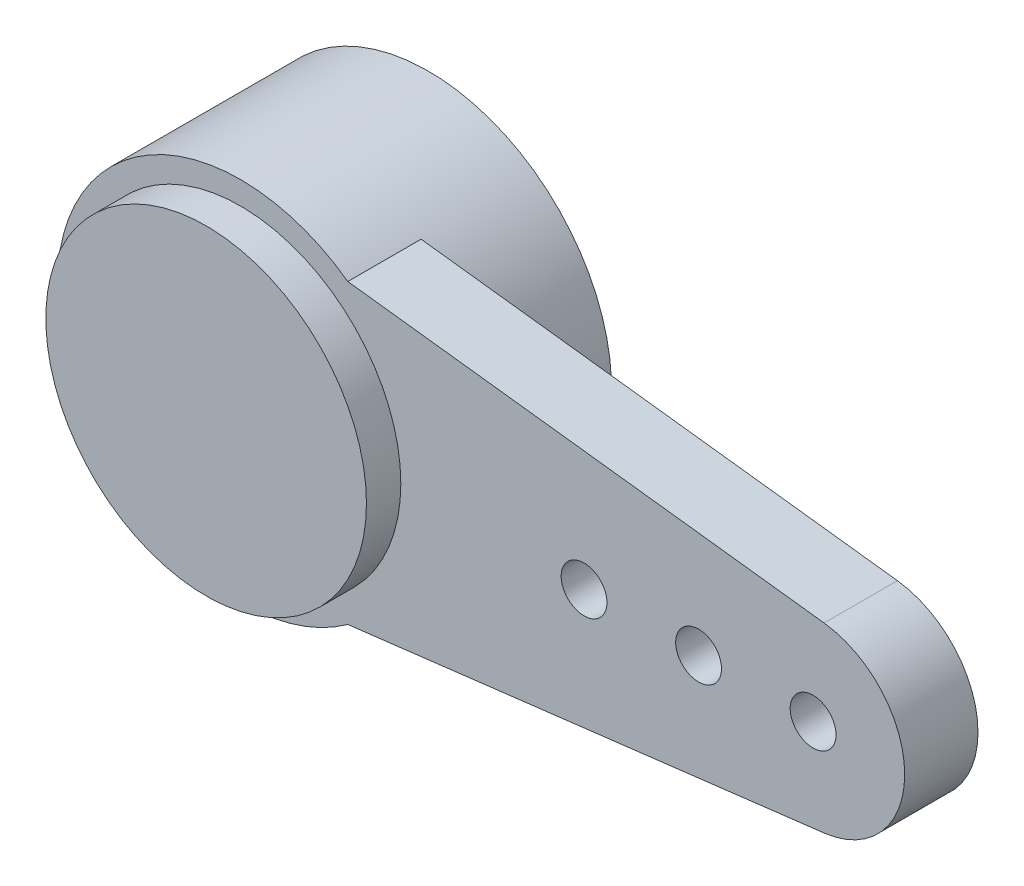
ISO-10303-21;
HEADER;
FILE_DESCRIPTION(('STEP AP214'),'2;1');
FILE_NAME('part.step','',(''),(''),'','','');
FILE_SCHEMA(('AUTOMOTIVE_DESIGN { 1 0 10303 214 1 1 1 1 }'));
ENDSEC;
DATA;
#1=APPLICATION_CONTEXT('core data for automotive mechanical design processes');
#2=APPLICATION_PROTOCOL_DEFINITION('international standard','automotive_design',2000,#1);
#3=PRODUCT_CONTEXT('',#1,'mechanical');
#4=PRODUCT('Part','Part','',(#3));
#5=PRODUCT_RELATED_PRODUCT_CATEGORY('part','',(#4));
#6=PRODUCT_DEFINITION_FORMATION('','',#4);
#7=PRODUCT_DEFINITION_CONTEXT('part definition',#1,'design');
#8=PRODUCT_DEFINITION('design','',#6,#7);
#9=PRODUCT_DEFINITION_SHAPE('','',#8);
#10=(LENGTH_UNIT() NAMED_UNIT(*) SI_UNIT(.MILLI.,.METRE.));
#11=(NAMED_UNIT(*) PLANE_ANGLE_UNIT() SI_UNIT($,.RADIAN.));
#12=(NAMED_UNIT(*) SI_UNIT($,.STERADIAN.) SOLID_ANGLE_UNIT());
#13=UNCERTAINTY_MEASURE_WITH_UNIT(LENGTH_MEASURE(1.E-05),#10,'distance_accuracy_value','');
#14=(GEOMETRIC_REPRESENTATION_CONTEXT(3) GLOBAL_UNCERTAINTY_ASSIGNED_CONTEXT((#13)) GLOBAL_UNIT_ASSIGNED_CONTEXT((#10,
#11,#12)) REPRESENTATION_CONTEXT('',''));
#15=CARTESIAN_POINT('',(0.,0.,0.));
#16=DIRECTION('',(0.,0.,1.));
#17=DIRECTION('',(1.,0.,0.));
#18=AXIS2_PLACEMENT_3D('',#15,#16,#17);
#19=CARTESIAN_POINT('',(0.,0.,1.6));
#20=DIRECTION('',(0.,0.,1.));
#21=DIRECTION('',(1.,0.,0.));
#22=AXIS2_PLACEMENT_3D('',#19,#20,#21);
#23=PLANE('',#22);
#24=DIRECTION('',(-0.992773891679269,0.12,0.));
#25=VECTOR('',#24,1.);
#26=CARTESIAN_POINT('',(0.42,3.47470862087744,1.6));
#27=LINE('',#26,#25);
#28=CARTESIAN_POINT('',(12.74,1.98554778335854,1.6));
#29=VERTEX_POINT('',#28);
#30=CARTESIAN_POINT('',(2.34249837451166,3.242329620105,1.6));
#31=VERTEX_POINT('',#30);
#32=EDGE_CURVE('E87',#29,#31,#27,.T.);
#33=ORIENTED_EDGE('',*,*,#32,.T.);
#34=CARTESIAN_POINT('',(0.,0.,1.6));
#35=DIRECTION('',(0.,0.,1.));
#36=DIRECTION('',(1.,0.,0.));
#37=AXIS2_PLACEMENT_3D('',#34,#35,#36);
#38=CIRCLE('',#37,4.);
#39=CARTESIAN_POINT('',(2.34249837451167,-3.242329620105,1.6));
#40=VERTEX_POINT('',#39);
#41=EDGE_CURVE('E49',#40,#31,#38,.F.);
#42=ORIENTED_EDGE('',*,*,#41,.F.);
#43=DIRECTION('',(0.992773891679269,0.12,0.));
#44=VECTOR('',#43,1.);
#45=CARTESIAN_POINT('',(12.74,-1.98554778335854,1.6));
#46=LINE('',#45,#44);
#47=CARTESIAN_POINT('',(12.74,-1.98554778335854,1.6));
#48=VERTEX_POINT('',#47);
#49=EDGE_CURVE('E36',#40,#48,#46,.T.);
#50=ORIENTED_EDGE('',*,*,#49,.T.);
#51=CARTESIAN_POINT('',(12.5,0.,1.6));
#52=DIRECTION('',(0.,0.,1.));
#53=DIRECTION('',(1.,0.,0.));
#54=AXIS2_PLACEMENT_3D('',#51,#52,#53);
#55=CIRCLE('',#54,2.);
#56=EDGE_CURVE('E57',#48,#29,#55,.T.);
#57=ORIENTED_EDGE('',*,*,#56,.T.);
#58=EDGE_LOOP('',(#33,#42,#50,#57));
#59=FACE_BOUND('',#58,.T.);
#60=CARTESIAN_POINT('',(10.,0.,1.6));
#61=DIRECTION('',(0.,0.,1.));
#62=DIRECTION('',(1.,0.,0.));
#63=AXIS2_PLACEMENT_3D('',#60,#61,#62);
#64=CIRCLE('',#63,0.500000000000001);
#65=CARTESIAN_POINT('',(10.5,0.,1.6));
#66=VERTEX_POINT('',#65);
#67=EDGE_CURVE('E114',#66,#66,#64,.T.);
#68=ORIENTED_EDGE('',*,*,#67,.F.);
#69=EDGE_LOOP('',(#68));
#70=FACE_BOUND('',#69,.T.);
#71=CARTESIAN_POINT('',(7.5,0.,1.6));
#72=DIRECTION('',(0.,0.,1.));
#73=DIRECTION('',(1.,0.,0.));
#74=AXIS2_PLACEMENT_3D('',#71,#72,#73);
#75=CIRCLE('',#74,0.500000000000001);
#76=CARTESIAN_POINT('',(8.,0.,1.6));
#77=VERTEX_POINT('',#76);
#78=EDGE_CURVE('E107',#77,#77,#75,.T.);
#79=ORIENTED_EDGE('',*,*,#78,.F.);
#80=EDGE_LOOP('',(#79));
#81=FACE_BOUND('',#80,.T.);
#82=CARTESIAN_POINT('',(12.5,0.,1.6));
#83=DIRECTION('',(0.,0.,1.));
#84=DIRECTION('',(1.,0.,0.));
#85=AXIS2_PLACEMENT_3D('',#82,#83,#84);
#86=CIRCLE('',#85,0.500000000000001);
#87=CARTESIAN_POINT('',(13.,0.,1.6));
#88=VERTEX_POINT('',#87);
#89=EDGE_CURVE('E119',#88,#88,#86,.T.);
#90=ORIENTED_EDGE('',*,*,#89,.F.);
#91=EDGE_LOOP('',(#90));
#92=FACE_BOUND('',#91,.T.);
#93=CARTESIAN_POINT('',(0.,0.,1.6));
#94=DIRECTION('',(0.,0.,1.));
#95=DIRECTION('',(1.,0.,0.));
#96=AXIS2_PLACEMENT_3D('',#93,#94,#95);
#97=CIRCLE('',#96,3.5);
#98=CARTESIAN_POINT('',(3.5,0.,1.6));
#99=VERTEX_POINT('',#98);
#100=EDGE_CURVE('E42',#99,#99,#97,.T.);
#101=ORIENTED_EDGE('',*,*,#100,.F.);
#102=EDGE_LOOP('',(#101));
#103=FACE_BOUND('',#102,.T.);
#104=ADVANCED_FACE('F32',(#59,#70,#81,#92,#103),#23,.T.);
#105=CARTESIAN_POINT('',(0.,0.,0.));
#106=DIRECTION('',(0.,0.,1.));
#107=DIRECTION('',(1.,0.,0.));
#108=AXIS2_PLACEMENT_3D('',#105,#106,#107);
#109=PLANE('',#108);
#110=CARTESIAN_POINT('',(10.,0.,0.));
#111=DIRECTION('',(0.,0.,1.));
#112=DIRECTION('',(1.,0.,0.));
#113=AXIS2_PLACEMENT_3D('',#110,#111,#112);
#114=CIRCLE('',#113,0.500000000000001);
#115=CARTESIAN_POINT('',(10.5,0.,0.));
#116=VERTEX_POINT('',#115);
#117=EDGE_CURVE('E116',#116,#116,#114,.T.);
#118=ORIENTED_EDGE('',*,*,#117,.T.);
#119=EDGE_LOOP('',(#118));
#120=FACE_BOUND('',#119,.T.);
#121=DIRECTION('',(0.992773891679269,0.12,0.));
#122=VECTOR('',#121,1.);
#123=CARTESIAN_POINT('',(12.74,-1.98554778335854,0.));
#124=LINE('',#123,#122);
#125=CARTESIAN_POINT('',(2.34249837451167,-3.242329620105,0.));
#126=VERTEX_POINT('',#125);
#127=CARTESIAN_POINT('',(12.74,-1.98554778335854,0.));
#128=VERTEX_POINT('',#127);
#129=EDGE_CURVE('E81',#126,#128,#124,.T.);
#130=ORIENTED_EDGE('',*,*,#129,.F.);
#131=CARTESIAN_POINT('',(0.,0.,0.));
#132=DIRECTION('',(0.,0.,1.));
#133=DIRECTION('',(1.,0.,0.));
#134=AXIS2_PLACEMENT_3D('',#131,#132,#133);
#135=CIRCLE('',#134,4.);
#136=CARTESIAN_POINT('',(2.34249837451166,3.242329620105,0.));
#137=VERTEX_POINT('',#136);
#138=EDGE_CURVE('E93',#126,#137,#135,.T.);
#139=ORIENTED_EDGE('',*,*,#138,.T.);
#140=DIRECTION('',(-0.992773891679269,0.12,0.));
#141=VECTOR('',#140,1.);
#142=CARTESIAN_POINT('',(0.42,3.47470862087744,0.));
#143=LINE('',#142,#141);
#144=CARTESIAN_POINT('',(12.74,1.98554778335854,0.));
#145=VERTEX_POINT('',#144);
#146=EDGE_CURVE('E80',#145,#137,#143,.T.);
#147=ORIENTED_EDGE('',*,*,#146,.F.);
#148=CARTESIAN_POINT('',(12.5,0.,0.));
#149=DIRECTION('',(0.,0.,1.));
#150=DIRECTION('',(1.,0.,0.));
#151=AXIS2_PLACEMENT_3D('',#148,#149,#150);
#152=CIRCLE('',#151,2.);
#153=EDGE_CURVE('E70',#128,#145,#152,.T.);
#154=ORIENTED_EDGE('',*,*,#153,.F.);
#155=EDGE_LOOP('',(#130,#139,#147,#154));
#156=FACE_BOUND('',#155,.T.);
#157=CARTESIAN_POINT('',(7.5,0.,0.));
#158=DIRECTION('',(0.,0.,1.));
#159=DIRECTION('',(1.,0.,0.));
#160=AXIS2_PLACEMENT_3D('',#157,#158,#159);
#161=CIRCLE('',#160,0.500000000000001);
#162=CARTESIAN_POINT('',(8.,0.,0.));
#163=VERTEX_POINT('',#162);
#164=EDGE_CURVE('E105',#163,#163,#161,.T.);
#165=ORIENTED_EDGE('',*,*,#164,.T.);
#166=EDGE_LOOP('',(#165));
#167=FACE_BOUND('',#166,.T.);
#168=CARTESIAN_POINT('',(12.5,0.,0.));
#169=DIRECTION('',(0.,0.,1.));
#170=DIRECTION('',(1.,0.,0.));
#171=AXIS2_PLACEMENT_3D('',#168,#169,#170);
#172=CIRCLE('',#171,0.500000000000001);
#173=CARTESIAN_POINT('',(13.,0.,0.));
#174=VERTEX_POINT('',#173);
#175=EDGE_CURVE('E122',#174,#174,#172,.T.);
#176=ORIENTED_EDGE('',*,*,#175,.T.);
#177=EDGE_LOOP('',(#176));
#178=FACE_BOUND('',#177,.T.);
#179=ADVANCED_FACE('F90',(#120,#156,#167,#178),#109,.F.);
#180=CARTESIAN_POINT('',(0.,0.,1.6));
#181=DIRECTION('',(0.,0.,-1.));
#182=DIRECTION('',(-1.,0.,0.));
#183=AXIS2_PLACEMENT_3D('',#180,#181,#182);
#184=CYLINDRICAL_SURFACE('',#183,3.5);
#185=ORIENTED_EDGE('',*,*,#100,.T.);
#186=EDGE_LOOP('',(#185));
#187=FACE_BOUND('',#186,.T.);
#188=CARTESIAN_POINT('',(0.,0.,2.35));
#189=DIRECTION('',(0.,0.,1.));
#190=DIRECTION('',(1.,0.,0.));
#191=AXIS2_PLACEMENT_3D('',#188,#189,#190);
#192=CIRCLE('',#191,3.5);
#193=CARTESIAN_POINT('',(3.5,0.,2.35));
#194=VERTEX_POINT('',#193);
#195=EDGE_CURVE('E125',#194,#194,#192,.T.);
#196=ORIENTED_EDGE('',*,*,#195,.F.);
#197=EDGE_LOOP('',(#196));
#198=FACE_BOUND('',#197,.T.);
#199=ADVANCED_FACE('F34',(#187,#198),#184,.T.);
#200=CARTESIAN_POINT('',(12.74,-1.98554778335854,1.6));
#201=DIRECTION('',(-0.12,0.992773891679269,0.));
#202=DIRECTION('',(-0.992773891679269,-0.12,0.));
#203=AXIS2_PLACEMENT_3D('',#200,#201,#202);
#204=PLANE('',#203);
#205=ORIENTED_EDGE('',*,*,#49,.F.);
#206=DIRECTION('',(0.,0.,-1.));
#207=VECTOR('',#206,1.);
#208=CARTESIAN_POINT('',(2.34249837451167,-3.242329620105,12.9137084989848));
#209=LINE('',#208,#207);
#210=EDGE_CURVE('E130',#40,#126,#209,.T.);
#211=ORIENTED_EDGE('',*,*,#210,.T.);
#212=ORIENTED_EDGE('',*,*,#129,.T.);
#213=DIRECTION('',(0.,0.,-1.));
#214=VECTOR('',#213,1.);
#215=CARTESIAN_POINT('',(12.74,-1.98554778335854,1.6));
#216=LINE('',#215,#214);
#217=EDGE_CURVE('E76',#48,#128,#216,.T.);
#218=ORIENTED_EDGE('',*,*,#217,.F.);
#219=EDGE_LOOP('',(#205,#211,#212,#218));
#220=FACE_BOUND('',#219,.T.);
#221=ADVANCED_FACE('F166',(#220),#204,.F.);
#222=CARTESIAN_POINT('',(12.5,0.,1.6));
#223=DIRECTION('',(0.,0.,-1.));
#224=DIRECTION('',(-1.,0.,0.));
#225=AXIS2_PLACEMENT_3D('',#222,#223,#224);
#226=CYLINDRICAL_SURFACE('',#225,2.);
#227=ORIENTED_EDGE('',*,*,#153,.T.);
#228=DIRECTION('',(0.,0.,-1.));
#229=VECTOR('',#228,1.);
#230=CARTESIAN_POINT('',(12.74,1.98554778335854,1.6));
#231=LINE('',#230,#229);
#232=EDGE_CURVE('E73',#29,#145,#231,.T.);
#233=ORIENTED_EDGE('',*,*,#232,.F.);
#234=ORIENTED_EDGE('',*,*,#56,.F.);
#235=ORIENTED_EDGE('',*,*,#217,.T.);
#236=EDGE_LOOP('',(#227,#233,#234,#235));
#237=FACE_BOUND('',#236,.T.);
#238=ADVANCED_FACE('F72',(#237),#226,.T.);
#239=CARTESIAN_POINT('',(0.42,3.47470862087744,1.6));
#240=DIRECTION('',(-0.12,-0.992773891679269,0.));
#241=DIRECTION('',(0.992773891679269,-0.12,0.));
#242=AXIS2_PLACEMENT_3D('',#239,#240,#241);
#243=PLANE('',#242);
#244=ORIENTED_EDGE('',*,*,#146,.T.);
#245=DIRECTION('',(0.,0.,-1.));
#246=VECTOR('',#245,1.);
#247=CARTESIAN_POINT('',(2.34249837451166,3.242329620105,12.9137084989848));
#248=LINE('',#247,#246);
#249=EDGE_CURVE('E11',#137,#31,#248,.F.);
#250=ORIENTED_EDGE('',*,*,#249,.T.);
#251=ORIENTED_EDGE('',*,*,#32,.F.);
#252=ORIENTED_EDGE('',*,*,#232,.T.);
#253=EDGE_LOOP('',(#244,#250,#251,#252));
#254=FACE_BOUND('',#253,.T.);
#255=ADVANCED_FACE('F85',(#254),#243,.F.);
#256=CARTESIAN_POINT('',(7.5,0.,1.6));
#257=DIRECTION('',(0.,0.,-1.));
#258=DIRECTION('',(-1.,0.,0.));
#259=AXIS2_PLACEMENT_3D('',#256,#257,#258);
#260=CYLINDRICAL_SURFACE('',#259,0.500000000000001);
#261=ORIENTED_EDGE('',*,*,#78,.T.);
#262=EDGE_LOOP('',(#261));
#263=FACE_BOUND('',#262,.T.);
#264=ORIENTED_EDGE('',*,*,#164,.F.);
#265=EDGE_LOOP('',(#264));
#266=FACE_BOUND('',#265,.T.);
#267=ADVANCED_FACE('F182',(#263,#266),#260,.F.);
#268=CARTESIAN_POINT('',(10.,0.,1.6));
#269=DIRECTION('',(0.,0.,-1.));
#270=DIRECTION('',(-1.,0.,0.));
#271=AXIS2_PLACEMENT_3D('',#268,#269,#270);
#272=CYLINDRICAL_SURFACE('',#271,0.500000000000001);
#273=ORIENTED_EDGE('',*,*,#67,.T.);
#274=EDGE_LOOP('',(#273));
#275=FACE_BOUND('',#274,.T.);
#276=ORIENTED_EDGE('',*,*,#117,.F.);
#277=EDGE_LOOP('',(#276));
#278=FACE_BOUND('',#277,.T.);
#279=ADVANCED_FACE('F189',(#275,#278),#272,.F.);
#280=CARTESIAN_POINT('',(12.5,0.,1.6));
#281=DIRECTION('',(0.,0.,-1.));
#282=DIRECTION('',(-1.,0.,0.));
#283=AXIS2_PLACEMENT_3D('',#280,#281,#282);
#284=CYLINDRICAL_SURFACE('',#283,0.500000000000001);
#285=ORIENTED_EDGE('',*,*,#89,.T.);
#286=EDGE_LOOP('',(#285));
#287=FACE_BOUND('',#286,.T.);
#288=ORIENTED_EDGE('',*,*,#175,.F.);
#289=EDGE_LOOP('',(#288));
#290=FACE_BOUND('',#289,.T.);
#291=ADVANCED_FACE('F193',(#287,#290),#284,.F.);
#292=CARTESIAN_POINT('',(0.,0.,2.35));
#293=DIRECTION('',(0.,0.,1.));
#294=DIRECTION('',(1.,0.,0.));
#295=AXIS2_PLACEMENT_3D('',#292,#293,#294);
#296=PLANE('',#295);
#297=ORIENTED_EDGE('',*,*,#195,.T.);
#298=EDGE_LOOP('',(#297));
#299=FACE_BOUND('',#298,.T.);
#300=ADVANCED_FACE('F160',(#299),#296,.T.);
#301=CARTESIAN_POINT('',(0.,0.,12.9137084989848));
#302=DIRECTION('',(0.,0.,-1.));
#303=DIRECTION('',(-1.,0.,0.));
#304=AXIS2_PLACEMENT_3D('',#301,#302,#303);
#305=CYLINDRICAL_SURFACE('',#304,4.);
#306=CARTESIAN_POINT('',(0.,0.,-2.5));
#307=DIRECTION('',(0.,0.,-1.));
#308=DIRECTION('',(-1.,0.,0.));
#309=AXIS2_PLACEMENT_3D('',#306,#307,#308);
#310=CIRCLE('',#309,4.);
#311=CARTESIAN_POINT('',(-4.,0.,-2.5));
#312=VERTEX_POINT('',#311);
#313=EDGE_CURVE('E134',#312,#312,#310,.T.);
#314=ORIENTED_EDGE('',*,*,#313,.F.);
#315=EDGE_LOOP('',(#314));
#316=FACE_BOUND('',#315,.T.);
#317=ORIENTED_EDGE('',*,*,#210,.F.);
#318=ORIENTED_EDGE('',*,*,#41,.T.);
#319=ORIENTED_EDGE('',*,*,#249,.F.);
#320=ORIENTED_EDGE('',*,*,#138,.F.);
#321=EDGE_LOOP('',(#317,#318,#319,#320));
#322=FACE_BOUND('',#321,.T.);
#323=ADVANCED_FACE('F155',(#316,#322),#305,.T.);
#324=CARTESIAN_POINT('',(0.,0.,-2.5));
#325=DIRECTION('',(0.,0.,-1.));
#326=DIRECTION('',(-1.,0.,0.));
#327=AXIS2_PLACEMENT_3D('',#324,#325,#326);
#328=PLANE('',#327);
#329=CARTESIAN_POINT('',(0.,0.,-2.5));
#330=DIRECTION('',(0.,0.,-1.));
#331=DIRECTION('',(-1.,0.,0.));
#332=AXIS2_PLACEMENT_3D('',#329,#330,#331);
#333=CIRCLE('',#332,2.9);
#334=CARTESIAN_POINT('',(-2.9,0.,-2.5));
#335=VERTEX_POINT('',#334);
#336=EDGE_CURVE('E138',#335,#335,#333,.T.);
#337=ORIENTED_EDGE('',*,*,#336,.F.);
#338=EDGE_LOOP('',(#337));
#339=FACE_BOUND('',#338,.T.);
#340=ORIENTED_EDGE('',*,*,#313,.T.);
#341=EDGE_LOOP('',(#340));
#342=FACE_BOUND('',#341,.T.);
#343=ADVANCED_FACE('F149',(#339,#342),#328,.T.);
#344=CARTESIAN_POINT('',(0.,0.,0.2));
#345=DIRECTION('',(0.,0.,-1.));
#346=DIRECTION('',(-1.,0.,0.));
#347=AXIS2_PLACEMENT_3D('',#344,#345,#346);
#348=CYLINDRICAL_SURFACE('',#347,2.9);
#349=CARTESIAN_POINT('',(0.,0.,0.2));
#350=DIRECTION('',(0.,0.,-1.));
#351=DIRECTION('',(-1.,0.,0.));
#352=AXIS2_PLACEMENT_3D('',#349,#350,#351);
#353=CIRCLE('',#352,2.9);
#354=CARTESIAN_POINT('',(-2.9,0.,0.2));
#355=VERTEX_POINT('',#354);
#356=EDGE_CURVE('E137',#355,#355,#353,.T.);
#357=CARTESIAN_POINT('',(-2.9,0.,0.2));
#358=CARTESIAN_POINT('',(-2.9,0.,0.171875));
#359=CARTESIAN_POINT('',(-2.9,0.,0.14375));
#360=CARTESIAN_POINT('',(-2.9,0.,0.0875000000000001));
#361=CARTESIAN_POINT('',(-2.9,0.,0.0593750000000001));
#362=CARTESIAN_POINT('',(-2.9,0.,0.00312500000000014));
#363=CARTESIAN_POINT('',(-2.9,0.,-0.0249999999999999));
#364=CARTESIAN_POINT('',(-2.9,0.,-0.0812499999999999));
#365=CARTESIAN_POINT('',(-2.9,0.,-0.109375));
#366=CARTESIAN_POINT('',(-2.9,0.,-0.165625));
#367=CARTESIAN_POINT('',(-2.9,0.,-0.19375));
#368=CARTESIAN_POINT('',(-2.9,0.,-0.25));
#369=CARTESIAN_POINT('',(-2.9,0.,-0.278125));
#370=CARTESIAN_POINT('',(-2.9,0.,-0.334375));
#371=CARTESIAN_POINT('',(-2.9,0.,-0.3625));
#372=CARTESIAN_POINT('',(-2.9,0.,-0.41875));
#373=CARTESIAN_POINT('',(-2.9,0.,-0.446875));
#374=CARTESIAN_POINT('',(-2.9,0.,-0.503125));
#375=CARTESIAN_POINT('',(-2.9,0.,-0.53125));
#376=CARTESIAN_POINT('',(-2.9,0.,-0.5875));
#377=CARTESIAN_POINT('',(-2.9,0.,-0.615625));
#378=CARTESIAN_POINT('',(-2.9,0.,-0.671875));
#379=CARTESIAN_POINT('',(-2.9,0.,-0.7));
#380=CARTESIAN_POINT('',(-2.9,0.,-0.75625));
#381=CARTESIAN_POINT('',(-2.9,0.,-0.784375));
#382=CARTESIAN_POINT('',(-2.9,0.,-0.840625));
#383=CARTESIAN_POINT('',(-2.9,0.,-0.86875));
#384=CARTESIAN_POINT('',(-2.9,0.,-0.925));
#385=CARTESIAN_POINT('',(-2.9,0.,-0.953125));
#386=CARTESIAN_POINT('',(-2.9,0.,-1.009375));
#387=CARTESIAN_POINT('',(-2.9,0.,-1.0375));
#388=CARTESIAN_POINT('',(-2.9,0.,-1.09375));
#389=CARTESIAN_POINT('',(-2.9,0.,-1.121875));
#390=CARTESIAN_POINT('',(-2.9,0.,-1.178125));
#391=CARTESIAN_POINT('',(-2.9,0.,-1.20625));
#392=CARTESIAN_POINT('',(-2.9,0.,-1.2625));
#393=CARTESIAN_POINT('',(-2.9,0.,-1.290625));
#394=CARTESIAN_POINT('',(-2.9,0.,-1.346875));
#395=CARTESIAN_POINT('',(-2.9,0.,-1.375));
#396=CARTESIAN_POINT('',(-2.9,0.,-1.43125));
#397=CARTESIAN_POINT('',(-2.9,0.,-1.459375));
#398=CARTESIAN_POINT('',(-2.9,0.,-1.515625));
#399=CARTESIAN_POINT('',(-2.9,0.,-1.54375));
#400=CARTESIAN_POINT('',(-2.9,0.,-1.6));
#401=CARTESIAN_POINT('',(-2.9,0.,-1.628125));
#402=CARTESIAN_POINT('',(-2.9,0.,-1.684375));
#403=CARTESIAN_POINT('',(-2.9,0.,-1.7125));
#404=CARTESIAN_POINT('',(-2.9,0.,-1.76875));
#405=CARTESIAN_POINT('',(-2.9,0.,-1.796875));
#406=CARTESIAN_POINT('',(-2.9,0.,-1.853125));
#407=CARTESIAN_POINT('',(-2.9,0.,-1.88125));
#408=CARTESIAN_POINT('',(-2.9,0.,-1.9375));
#409=CARTESIAN_POINT('',(-2.9,0.,-1.965625));
#410=CARTESIAN_POINT('',(-2.9,0.,-2.021875));
#411=CARTESIAN_POINT('',(-2.9,0.,-2.05));
#412=CARTESIAN_POINT('',(-2.9,0.,-2.10625));
#413=CARTESIAN_POINT('',(-2.9,0.,-2.134375));
#414=CARTESIAN_POINT('',(-2.9,0.,-2.190625));
#415=CARTESIAN_POINT('',(-2.9,0.,-2.21875));
#416=CARTESIAN_POINT('',(-2.9,0.,-2.275));
#417=CARTESIAN_POINT('',(-2.9,0.,-2.303125));
#418=CARTESIAN_POINT('',(-2.9,0.,-2.359375));
#419=CARTESIAN_POINT('',(-2.9,0.,-2.3875));
#420=CARTESIAN_POINT('',(-2.9,0.,-2.44375));
#421=CARTESIAN_POINT('',(-2.9,0.,-2.471875));
#422=CARTESIAN_POINT('',(-2.9,0.,-2.5));
#423=B_SPLINE_CURVE_WITH_KNOTS('',3,(#357,#358,#359,#360,#361,#362,#363,#364,#365,#366,#367,
#368,#369,#370,#371,#372,#373,#374,#375,#376,#377,#378,#379,#380,#381,#382,#383,#384,#385,#386,
#387,#388,#389,#390,#391,#392,#393,#394,#395,#396,#397,#398,#399,#400,#401,#402,#403,#404,#405,
#406,#407,#408,#409,#410,#411,#412,#413,#414,#415,#416,#417,#418,#419,#420,#421,#422),
.UNSPECIFIED.,.F.,.F.,(4,2,2,2,2,2,2,2,2,2,2,2,2,2,2,2,2,2,2,2,2,2,2,2,2,2,2,2,2,2,2,2,4),(0.,
0.084375,0.16875,0.253125,0.3375,0.421875,0.50625,0.590625,0.675,0.759375,0.84375,0.928125,
1.0125,1.096875,1.18125,1.265625,1.35,1.434375,1.51875,1.603125,1.6875,1.771875,1.85625,
1.940625,2.025,2.109375,2.19375,2.278125,2.3625,2.446875,2.53125,2.615625,2.7),.UNSPECIFIED.);
#424=EDGE_CURVE('BSEAM146',#355,#335,#423,.T.);
#425=ORIENTED_EDGE('',*,*,#356,.F.);
#426=ORIENTED_EDGE('',*,*,#336,.T.);
#427=ORIENTED_EDGE('',*,*,#424,.T.);
#428=ORIENTED_EDGE('',*,*,#424,.F.);
#429=EDGE_LOOP('',(#425,#427,#426,#428));
#430=FACE_BOUND('',#429,.T.);
#431=ADVANCED_FACE('F146',(#430),#348,.F.);
#432=CARTESIAN_POINT('',(0.,0.,0.2));
#433=DIRECTION('',(0.,0.,-1.));
#434=DIRECTION('',(-1.,0.,0.));
#435=AXIS2_PLACEMENT_3D('',#432,#433,#434);
#436=PLANE('',#435);
#437=ORIENTED_EDGE('',*,*,#356,.T.);
#438=EDGE_LOOP('',(#437));
#439=FACE_BOUND('',#438,.T.);
#440=ADVANCED_FACE('F144',(#439),#436,.T.);
#441=CLOSED_SHELL('',(#104,#179,#199,#221,#238,#255,#267,#279,#291,#300,#323,#343,#431,#440));
#442=MANIFOLD_SOLID_BREP('B2',#441);
#443=ADVANCED_BREP_SHAPE_REPRESENTATION('',(#18,#442),#14);
#444=SHAPE_DEFINITION_REPRESENTATION(#9,#443);
ENDSEC;
END-ISO-10303-21;
